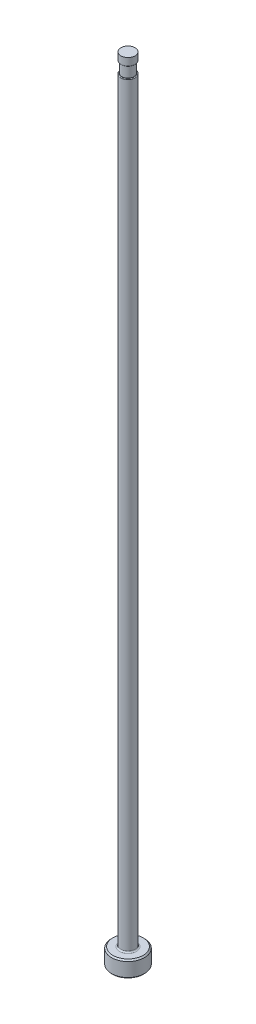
from build123d import *

# Parameters (mm, degrees)
CHAMFER1_SIZE     = 0.254
FILLET1_R         = 0.254
SKETCH2_W         = 0.2032
SKETCH2_H         = 2.032
D_SLOT_DEPTH      = 153.466131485
D_SLOT_DEPTH_BACK = 153.466131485
SKETCH5_W         = 0.0254
SKETCH5_H         = 1.524
FILLET2_R         = 0.127


with BuildPart() as part:
    # Sketch1 → Revolve1 (revolve)
    with BuildSketch(Plane.XY, mode=Mode.PRIVATE) as revolve1_sk:
        Polygon((0, 0), (-3.175, 0), (-3.175, 3.175), (-1.38811, 3.175), (-1.38811, 152.4), (0, 152.4), align=None)
    revolve(revolve1_sk.sketch.rotate(Axis((0, 259.958771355, 0), (0, -1, 0)), 270), axis=Axis((0, 259.958771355, 0), (0, -1, 0)))

    # Chamfer1
    chamfer1_edges = [part.edges().sort_by_distance(p)[0] for p in [
        (0, 3.175, -3.175),
        (0, 0, -3.175),
    ]]
    chamfer(chamfer1_edges, length=CHAMFER1_SIZE)

    # Fillet1
    fillet1_edges = [part.edges().sort_by_distance(p)[0] for p in [
        (0, 3.175, -1.38811),
    ]]
    fillet(fillet1_edges, radius=FILLET1_R)

    # Sketch2 → Vent Relief (revolve, cut)
    with BuildSketch(Plane.XY, mode=Mode.PRIVATE) as vent_relief_sk:
        with Locations((-1.28651, 149.86)):
            Rectangle(SKETCH2_W, SKETCH2_H)
    revolve(vent_relief_sk.sketch.rotate(Axis((0, 153.448281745, 0), (0, -1, 0)), 270), axis=Axis((0, 153.448281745, 0), (0, -1, 0)), mode=Mode.SUBTRACT)

    # Sketch3 → D-Slot (cut, two sides: drawn at the far end of the back side and taken through both)
    with BuildSketch(Plane.XY.offset(-D_SLOT_DEPTH_BACK)):
        with BuildLine():
            Line((-1.18491, 149.86), (-1.18491, 86.36))
            ThreePointArc((-1.18491, 86.36), (-1.236123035, 85.792038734), (-1.38811, 85.2424))
            Line((-1.38811, 85.2424), (-1.38811, 149.86))
            Line((-1.38811, 149.86), (-1.18491, 149.86))
        make_face()
    extrude(amount=D_SLOT_DEPTH + D_SLOT_DEPTH_BACK, mode=Mode.SUBTRACT)

    # Sketch5 → Vent Diameter (revolve, cut)
    with BuildSketch(Plane.XY, mode=Mode.PRIVATE) as vent_diameter_sk:
        with Locations((-1.37541, 151.638)):
            Rectangle(SKETCH5_W, SKETCH5_H)
    revolve(vent_diameter_sk.sketch.rotate(Axis((0, 152.687735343, 0), (0, -1, 0)), 90), axis=Axis((0, 152.687735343, 0), (0, -1, 0)), mode=Mode.SUBTRACT)

    # Fillet2
    fillet2_edges = [part.edges().sort_by_distance(p)[0] for p in [
        (1.210486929, 148.844, -0.679389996),
        (0, 150.876, 1.36271),
    ]]
    fillet(fillet2_edges, radius=FILLET2_R)


solid = part.part
